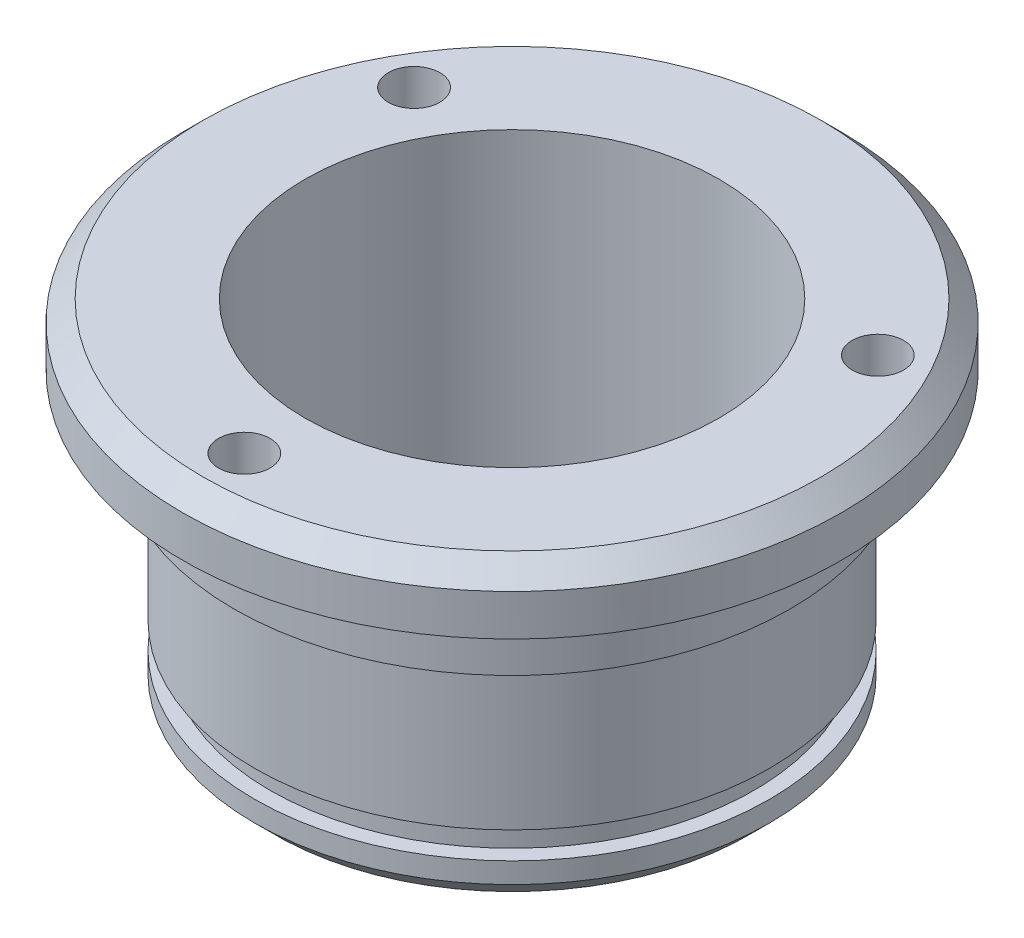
ISO-10303-21;
HEADER;
FILE_DESCRIPTION(('STEP AP214'),'2;1');
FILE_NAME('part.step','',(''),(''),'','','');
FILE_SCHEMA(('AUTOMOTIVE_DESIGN { 1 0 10303 214 1 1 1 1 }'));
ENDSEC;
DATA;
#1=APPLICATION_CONTEXT('core data for automotive mechanical design processes');
#2=APPLICATION_PROTOCOL_DEFINITION('international standard','automotive_design',2000,#1);
#3=PRODUCT_CONTEXT('',#1,'mechanical');
#4=PRODUCT('Part','Part','',(#3));
#5=PRODUCT_RELATED_PRODUCT_CATEGORY('part','',(#4));
#6=PRODUCT_DEFINITION_FORMATION('','',#4);
#7=PRODUCT_DEFINITION_CONTEXT('part definition',#1,'design');
#8=PRODUCT_DEFINITION('design','',#6,#7);
#9=PRODUCT_DEFINITION_SHAPE('','',#8);
#10=(LENGTH_UNIT() NAMED_UNIT(*) SI_UNIT(.MILLI.,.METRE.));
#11=(NAMED_UNIT(*) PLANE_ANGLE_UNIT() SI_UNIT($,.RADIAN.));
#12=(NAMED_UNIT(*) SI_UNIT($,.STERADIAN.) SOLID_ANGLE_UNIT());
#13=UNCERTAINTY_MEASURE_WITH_UNIT(LENGTH_MEASURE(1.E-05),#10,'distance_accuracy_value','');
#14=(GEOMETRIC_REPRESENTATION_CONTEXT(3) GLOBAL_UNCERTAINTY_ASSIGNED_CONTEXT((#13)) GLOBAL_UNIT_ASSIGNED_CONTEXT((#10,
#11,#12)) REPRESENTATION_CONTEXT('',''));
#15=CARTESIAN_POINT('',(0.,0.,0.));
#16=DIRECTION('',(0.,0.,1.));
#17=DIRECTION('',(1.,0.,0.));
#18=AXIS2_PLACEMENT_3D('',#15,#16,#17);
#19=CARTESIAN_POINT('',(0.,0.,0.));
#20=DIRECTION('',(0.,-1.,0.));
#21=DIRECTION('',(0.,0.,-1.));
#22=AXIS2_PLACEMENT_3D('',#19,#20,#21);
#23=CYLINDRICAL_SURFACE('',#22,10.05);
#24=CARTESIAN_POINT('',(0.,0.,0.));
#25=DIRECTION('',(0.,-1.,0.));
#26=DIRECTION('',(0.,0.,-1.));
#27=AXIS2_PLACEMENT_3D('',#24,#25,#26);
#28=CIRCLE('',#27,10.05);
#29=CARTESIAN_POINT('',(0.,0.,-10.05));
#30=VERTEX_POINT('',#29);
#31=EDGE_CURVE('E346',#30,#30,#28,.T.);
#32=ORIENTED_EDGE('',*,*,#31,.T.);
#33=EDGE_LOOP('',(#32));
#34=FACE_BOUND('',#33,.T.);
#35=CARTESIAN_POINT('',(0.,16.8,0.));
#36=DIRECTION('',(0.,-1.,0.));
#37=DIRECTION('',(0.,0.,-1.));
#38=AXIS2_PLACEMENT_3D('',#35,#36,#37);
#39=CIRCLE('',#38,10.05);
#40=CARTESIAN_POINT('',(0.,16.8,-10.05));
#41=VERTEX_POINT('',#40);
#42=EDGE_CURVE('E325',#41,#41,#39,.T.);
#43=ORIENTED_EDGE('',*,*,#42,.F.);
#44=EDGE_LOOP('',(#43));
#45=FACE_BOUND('',#44,.T.);
#46=ADVANCED_FACE('F38',(#34,#45),#23,.F.);
#47=CARTESIAN_POINT('',(12.5,0.,0.));
#48=DIRECTION('',(0.,-1.,0.));
#49=DIRECTION('',(0.,0.,-1.));
#50=AXIS2_PLACEMENT_3D('',#47,#48,#49);
#51=PLANE('',#50);
#52=CARTESIAN_POINT('',(0.,0.,0.));
#53=DIRECTION('',(0.,-1.,0.));
#54=DIRECTION('',(0.,0.,-1.));
#55=AXIS2_PLACEMENT_3D('',#52,#53,#54);
#56=CIRCLE('',#55,11.5);
#57=CARTESIAN_POINT('',(0.,0.,-11.5));
#58=VERTEX_POINT('',#57);
#59=EDGE_CURVE('E348',#58,#58,#56,.T.);
#60=ORIENTED_EDGE('',*,*,#59,.T.);
#61=EDGE_LOOP('',(#60));
#62=FACE_BOUND('',#61,.T.);
#63=ORIENTED_EDGE('',*,*,#31,.F.);
#64=EDGE_LOOP('',(#63));
#65=FACE_BOUND('',#64,.T.);
#66=ADVANCED_FACE('F136',(#62,#65),#51,.T.);
#67=CARTESIAN_POINT('',(0.,0.,0.));
#68=DIRECTION('',(0.,-1.,0.));
#69=DIRECTION('',(0.,0.,-1.));
#70=AXIS2_PLACEMENT_3D('',#67,#68,#69);
#71=CYLINDRICAL_SURFACE('',#70,12.5);
#72=CARTESIAN_POINT('',(0.,1.00000000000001,0.));
#73=DIRECTION('',(0.,-1.,0.));
#74=DIRECTION('',(0.,0.,-1.));
#75=AXIS2_PLACEMENT_3D('',#72,#73,#74);
#76=CIRCLE('',#75,12.5);
#77=CARTESIAN_POINT('',(0.,1.00000000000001,-12.5));
#78=VERTEX_POINT('',#77);
#79=EDGE_CURVE('E351',#78,#78,#76,.F.);
#80=ORIENTED_EDGE('',*,*,#79,.T.);
#81=EDGE_LOOP('',(#80));
#82=FACE_BOUND('',#81,.T.);
#83=CARTESIAN_POINT('',(0.,2.,0.));
#84=DIRECTION('',(0.,-1.,0.));
#85=DIRECTION('',(0.,0.,-1.));
#86=AXIS2_PLACEMENT_3D('',#83,#84,#85);
#87=CIRCLE('',#86,12.5);
#88=CARTESIAN_POINT('',(0.,2.,-12.5));
#89=VERTEX_POINT('',#88);
#90=EDGE_CURVE('E343',#89,#89,#87,.T.);
#91=ORIENTED_EDGE('',*,*,#90,.T.);
#92=EDGE_LOOP('',(#91));
#93=FACE_BOUND('',#92,.T.);
#94=ADVANCED_FACE('F142',(#82,#93),#71,.T.);
#95=CARTESIAN_POINT('',(12.5,2.,0.));
#96=DIRECTION('',(0.,1.,0.));
#97=DIRECTION('',(0.,0.,1.));
#98=AXIS2_PLACEMENT_3D('',#95,#96,#97);
#99=PLANE('',#98);
#100=CARTESIAN_POINT('',(0.,2.,0.));
#101=DIRECTION('',(0.,-1.,0.));
#102=DIRECTION('',(0.,0.,-1.));
#103=AXIS2_PLACEMENT_3D('',#100,#101,#102);
#104=CIRCLE('',#103,11.75);
#105=CARTESIAN_POINT('',(0.,2.,-11.75));
#106=VERTEX_POINT('',#105);
#107=EDGE_CURVE('E340',#106,#106,#104,.T.);
#108=ORIENTED_EDGE('',*,*,#107,.T.);
#109=EDGE_LOOP('',(#108));
#110=FACE_BOUND('',#109,.T.);
#111=ORIENTED_EDGE('',*,*,#90,.F.);
#112=EDGE_LOOP('',(#111));
#113=FACE_BOUND('',#112,.T.);
#114=ADVANCED_FACE('F500',(#110,#113),#99,.T.);
#115=CARTESIAN_POINT('',(0.,0.,0.));
#116=DIRECTION('',(0.,-1.,0.));
#117=DIRECTION('',(0.,0.,-1.));
#118=AXIS2_PLACEMENT_3D('',#115,#116,#117);
#119=CYLINDRICAL_SURFACE('',#118,11.75);
#120=CARTESIAN_POINT('',(0.,3.3,0.));
#121=DIRECTION('',(0.,-1.,0.));
#122=DIRECTION('',(0.,0.,-1.));
#123=AXIS2_PLACEMENT_3D('',#120,#121,#122);
#124=CIRCLE('',#123,11.75);
#125=CARTESIAN_POINT('',(0.,3.3,-11.75));
#126=VERTEX_POINT('',#125);
#127=EDGE_CURVE('E337',#126,#126,#124,.T.);
#128=ORIENTED_EDGE('',*,*,#127,.T.);
#129=EDGE_LOOP('',(#128));
#130=FACE_BOUND('',#129,.T.);
#131=ORIENTED_EDGE('',*,*,#107,.F.);
#132=EDGE_LOOP('',(#131));
#133=FACE_BOUND('',#132,.T.);
#134=ADVANCED_FACE('F490',(#130,#133),#119,.T.);
#135=CARTESIAN_POINT('',(11.75,3.3,0.));
#136=DIRECTION('',(0.,-1.,0.));
#137=DIRECTION('',(0.,0.,-1.));
#138=AXIS2_PLACEMENT_3D('',#135,#136,#137);
#139=PLANE('',#138);
#140=CARTESIAN_POINT('',(0.,3.3,0.));
#141=DIRECTION('',(0.,-1.,0.));
#142=DIRECTION('',(0.,0.,-1.));
#143=AXIS2_PLACEMENT_3D('',#140,#141,#142);
#144=CIRCLE('',#143,12.5);
#145=CARTESIAN_POINT('',(0.,3.3,-12.5));
#146=VERTEX_POINT('',#145);
#147=EDGE_CURVE('E334',#146,#146,#144,.T.);
#148=ORIENTED_EDGE('',*,*,#147,.T.);
#149=EDGE_LOOP('',(#148));
#150=FACE_BOUND('',#149,.T.);
#151=ORIENTED_EDGE('',*,*,#127,.F.);
#152=EDGE_LOOP('',(#151));
#153=FACE_BOUND('',#152,.T.);
#154=ADVANCED_FACE('F482',(#150,#153),#139,.T.);
#155=CARTESIAN_POINT('',(0.,0.,0.));
#156=DIRECTION('',(0.,-1.,0.));
#157=DIRECTION('',(0.,0.,-1.));
#158=AXIS2_PLACEMENT_3D('',#155,#156,#157);
#159=CYLINDRICAL_SURFACE('',#158,12.5);
#160=CARTESIAN_POINT('',(0.,10.3,0.));
#161=DIRECTION('',(0.,-1.,0.));
#162=DIRECTION('',(0.,0.,-1.));
#163=AXIS2_PLACEMENT_3D('',#160,#161,#162);
#164=CIRCLE('',#163,12.5);
#165=CARTESIAN_POINT('',(0.,10.3,-12.5));
#166=VERTEX_POINT('',#165);
#167=EDGE_CURVE('E250',#166,#166,#164,.T.);
#168=ORIENTED_EDGE('',*,*,#167,.T.);
#169=EDGE_LOOP('',(#168));
#170=FACE_BOUND('',#169,.T.);
#171=ORIENTED_EDGE('',*,*,#147,.F.);
#172=EDGE_LOOP('',(#171));
#173=FACE_BOUND('',#172,.T.);
#174=ADVANCED_FACE('F476',(#170,#173),#159,.T.);
#175=CARTESIAN_POINT('',(12.5,10.5,0.));
#176=DIRECTION('',(0.,-1.,0.));
#177=DIRECTION('',(0.,0.,-1.));
#178=AXIS2_PLACEMENT_3D('',#175,#176,#177);
#179=PLANE('',#178);
#180=CARTESIAN_POINT('',(0.,10.5,0.));
#181=DIRECTION('',(0.,-1.,0.));
#182=DIRECTION('',(0.,0.,-1.));
#183=AXIS2_PLACEMENT_3D('',#180,#181,#182);
#184=CIRCLE('',#183,12.7);
#185=CARTESIAN_POINT('',(0.,10.5,-12.7));
#186=VERTEX_POINT('',#185);
#187=EDGE_CURVE('E252',#186,#186,#184,.F.);
#188=ORIENTED_EDGE('',*,*,#187,.T.);
#189=EDGE_LOOP('',(#188));
#190=FACE_BOUND('',#189,.T.);
#191=CARTESIAN_POINT('',(0.,10.5,0.));
#192=DIRECTION('',(0.,-1.,0.));
#193=DIRECTION('',(0.,0.,-1.));
#194=AXIS2_PLACEMENT_3D('',#191,#192,#193);
#195=CIRCLE('',#194,13.5);
#196=CARTESIAN_POINT('',(0.,10.5,-13.5));
#197=VERTEX_POINT('',#196);
#198=EDGE_CURVE('E331',#197,#197,#195,.T.);
#199=ORIENTED_EDGE('',*,*,#198,.T.);
#200=EDGE_LOOP('',(#199));
#201=FACE_BOUND('',#200,.T.);
#202=ADVANCED_FACE('F295',(#190,#201),#179,.T.);
#203=CARTESIAN_POINT('',(0.,0.,0.));
#204=DIRECTION('',(0.,-1.,0.));
#205=DIRECTION('',(0.,0.,-1.));
#206=AXIS2_PLACEMENT_3D('',#203,#204,#205);
#207=CYLINDRICAL_SURFACE('',#206,13.5);
#208=DIRECTION('',(0.,1.,0.));
#209=VECTOR('',#208,1.);
#210=CARTESIAN_POINT('',(-1.16637578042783,14.8,13.4495192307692));
#211=LINE('',#210,#209);
#212=CARTESIAN_POINT('',(-1.16637578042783,13.6,13.4495192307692));
#213=VERTEX_POINT('',#212);
#214=CARTESIAN_POINT('',(-1.16637578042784,12.8,13.4495192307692));
#215=VERTEX_POINT('',#214);
#216=EDGE_CURVE('E274',#213,#215,#211,.F.);
#217=ORIENTED_EDGE('',*,*,#216,.F.);
#218=CARTESIAN_POINT('',(0.,13.6,0.));
#219=DIRECTION('',(0.,-1.,0.));
#220=DIRECTION('',(0.,0.,-1.));
#221=AXIS2_PLACEMENT_3D('',#218,#219,#220);
#222=CIRCLE('',#221,13.5);
#223=CARTESIAN_POINT('',(-12.2308132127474,13.6,-5.71464855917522));
#224=VERTEX_POINT('',#223);
#225=EDGE_CURVE('E243',#213,#224,#222,.T.);
#226=ORIENTED_EDGE('',*,*,#225,.T.);
#227=DIRECTION('',(0.,1.,0.));
#228=VECTOR('',#227,1.);
#229=CARTESIAN_POINT('',(-12.2308132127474,14.8,-5.71464855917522));
#230=LINE('',#229,#228);
#231=CARTESIAN_POINT('',(-12.2308132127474,12.8,-5.71464855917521));
#232=VERTEX_POINT('',#231);
#233=EDGE_CURVE('E263',#232,#224,#230,.T.);
#234=ORIENTED_EDGE('',*,*,#233,.F.);
#235=CARTESIAN_POINT('',(-11.0642251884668,12.8002,-7.73517426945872));
#236=CARTESIAN_POINT('',(-11.0946707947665,12.771543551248,-7.6916232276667));
#237=CARTESIAN_POINT('',(-11.1249231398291,12.7430743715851,-7.64780564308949));
#238=CARTESIAN_POINT('',(-11.1851538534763,12.6868200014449,-7.55944475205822));
#239=CARTESIAN_POINT('',(-11.2151318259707,12.6590357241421,-7.51490059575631));
#240=CARTESIAN_POINT('',(-11.2764758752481,12.6030507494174,-7.42255539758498));
#241=CARTESIAN_POINT('',(-11.3078286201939,12.5749098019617,-7.37470911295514));
#242=CARTESIAN_POINT('',(-11.3704177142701,12.5206247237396,-7.27783821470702));
#243=CARTESIAN_POINT('',(-11.401654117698,12.4944795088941,-7.2288142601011));
#244=CARTESIAN_POINT('',(-11.44962177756,12.4572175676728,-7.15242192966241));
#245=CARTESIAN_POINT('',(-11.4662971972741,12.4447956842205,-7.12566064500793));
#246=CARTESIAN_POINT('',(-11.4997504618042,12.4214148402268,-7.07154523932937));
#247=CARTESIAN_POINT('',(-11.5165283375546,12.4104563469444,-7.04419093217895));
#248=CARTESIAN_POINT('',(-11.5499009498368,12.3907893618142,-6.98933465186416));
#249=CARTESIAN_POINT('',(-11.5664931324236,12.3820421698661,-6.96184529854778));
#250=CARTESIAN_POINT('',(-11.599789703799,12.3672769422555,-6.90622376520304));
#251=CARTESIAN_POINT('',(-11.6164939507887,12.3612559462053,-6.87809231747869));
#252=CARTESIAN_POINT('',(-11.6471219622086,12.3533942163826,-6.82607512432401));
#253=CARTESIAN_POINT('',(-11.6610418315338,12.3510214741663,-6.80226926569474));
#254=CARTESIAN_POINT('',(-11.6887826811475,12.3489307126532,-6.75448902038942));
#255=CARTESIAN_POINT('',(-11.7026036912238,12.3492118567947,-6.73051468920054));
#256=CARTESIAN_POINT('',(-11.7302640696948,12.3524230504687,-6.6821922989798));
#257=CARTESIAN_POINT('',(-11.7440994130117,12.3554000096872,-6.65784515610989));
#258=CARTESIAN_POINT('',(-11.7714408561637,12.3637430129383,-6.60938386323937));
#259=CARTESIAN_POINT('',(-11.784946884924,12.3691095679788,-6.58526976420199));
#260=CARTESIAN_POINT('',(-11.8195326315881,12.3855370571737,-6.5230792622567));
#261=CARTESIAN_POINT('',(-11.8403296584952,12.3980856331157,-6.48524539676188));
#262=CARTESIAN_POINT('',(-11.8810747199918,12.4263619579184,-6.41029547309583));
#263=CARTESIAN_POINT('',(-11.9010214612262,12.4420943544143,-6.37318055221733));
#264=CARTESIAN_POINT('',(-11.9403130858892,12.4756715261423,-6.29926069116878));
#265=CARTESIAN_POINT('',(-11.9596534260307,12.4935288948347,-6.26245914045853));
#266=CARTESIAN_POINT('',(-11.9977099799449,12.5305539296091,-6.1892370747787));
#267=CARTESIAN_POINT('',(-12.0164265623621,12.5497208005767,-6.15281634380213));
#268=CARTESIAN_POINT('',(-12.06938439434,12.605961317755,-6.0486167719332));
#269=CARTESIAN_POINT('',(-12.1029794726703,12.6441190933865,-5.98109702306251));
#270=CARTESIAN_POINT('',(-12.1520387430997,12.7022524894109,-5.88041824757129));
#271=CARTESIAN_POINT('',(-12.168063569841,12.721643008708,-5.84718596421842));
#272=CARTESIAN_POINT('',(-12.1997688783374,12.7607186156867,-5.7807434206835));
#273=CARTESIAN_POINT('',(-12.2154494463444,12.7804036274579,-5.7475331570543));
#274=CARTESIAN_POINT('',(-12.2309700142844,12.8002,-5.71431295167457));
#275=B_SPLINE_CURVE_WITH_KNOTS('',3,(#235,#236,#237,#238,#239,#240,#241,#242,#243,#244,#245,
#246,#247,#248,#249,#250,#251,#252,#253,#254,#255,#256,#257,#258,#259,#260,#261,#262,#263,#264,
#265,#266,#267,#268,#269,#270,#271,#272,#273,#274),.UNSPECIFIED.,.F.,.F.,(4,2,2,2,2,2,2,2,2,2,2,
2,2,2,2,2,2,2,2,4),(0.,0.181125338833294,0.362480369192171,0.553713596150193,0.744842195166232,
0.846487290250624,0.948164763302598,1.04791557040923,1.1475577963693,1.23047578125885,
1.31336762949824,1.39773018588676,1.48211079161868,1.61677285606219,1.75163293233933,
1.88733628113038,2.02295795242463,2.27645936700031,2.40149695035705,2.52650284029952),.UNSPECIFIED.);
#276=CARTESIAN_POINT('',(-11.0644374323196,12.8,-7.73487067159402));
#277=VERTEX_POINT('',#276);
#278=EDGE_CURVE('E279',#277,#232,#275,.T.);
#279=ORIENTED_EDGE('',*,*,#278,.F.);
#280=DIRECTION('',(0.,1.,0.));
#281=VECTOR('',#280,1.);
#282=CARTESIAN_POINT('',(-11.0644374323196,14.8,-7.73487067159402));
#283=LINE('',#282,#281);
#284=CARTESIAN_POINT('',(-11.0644374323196,13.6,-7.73487067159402));
#285=VERTEX_POINT('',#284);
#286=EDGE_CURVE('E307',#285,#277,#283,.F.);
#287=ORIENTED_EDGE('',*,*,#286,.F.);
#288=CARTESIAN_POINT('',(0.,13.6,0.));
#289=DIRECTION('',(0.,-1.,0.));
#290=DIRECTION('',(0.,0.,-1.));
#291=AXIS2_PLACEMENT_3D('',#288,#289,#290);
#292=CIRCLE('',#291,13.5);
#293=CARTESIAN_POINT('',(11.0644374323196,13.6,-7.73487067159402));
#294=VERTEX_POINT('',#293);
#295=EDGE_CURVE('E235',#285,#294,#292,.T.);
#296=ORIENTED_EDGE('',*,*,#295,.T.);
#297=DIRECTION('',(0.,1.,0.));
#298=VECTOR('',#297,1.);
#299=CARTESIAN_POINT('',(11.0644374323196,14.8,-7.73487067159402));
#300=LINE('',#299,#298);
#301=CARTESIAN_POINT('',(11.0644374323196,12.8,-7.73487067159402));
#302=VERTEX_POINT('',#301);
#303=EDGE_CURVE('E233',#302,#294,#300,.T.);
#304=ORIENTED_EDGE('',*,*,#303,.F.);
#305=CARTESIAN_POINT('',(12.2309700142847,12.8002000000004,-5.71431295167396));
#306=CARTESIAN_POINT('',(12.2084765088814,12.7715435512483,-5.76245514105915));
#307=CARTESIAN_POINT('',(12.1856555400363,12.7430743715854,-5.81056323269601));
#308=CARTESIAN_POINT('',(12.1392481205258,12.6868200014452,-5.90690500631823));
#309=CARTESIAN_POINT('',(12.1156607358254,12.6590357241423,-5.9551387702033));
#310=CARTESIAN_POINT('',(12.0663594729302,12.6030507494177,-6.05443687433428));
#311=CARTESIAN_POINT('',(12.0405997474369,12.574909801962,-6.10551229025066));
#312=CARTESIAN_POINT('',(11.9880016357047,12.5206247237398,-6.20815148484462));
#313=CARTESIAN_POINT('',(11.961163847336,12.4944795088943,-6.25971498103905));
#314=CARTESIAN_POINT('',(11.9189899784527,12.4572175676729,-6.33945235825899));
#315=CARTESIAN_POINT('',(11.9041517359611,12.4447956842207,-6.3672743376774));
#316=CARTESIAN_POINT('',(11.8740130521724,12.4214148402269,-6.42330341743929));
#317=CARTESIAN_POINT('',(11.8587124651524,12.4104563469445,-6.45151063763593));
#318=CARTESIAN_POINT('',(11.8278918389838,12.3907893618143,-6.50784030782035));
#319=CARTESIAN_POINT('',(11.8123814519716,12.3820421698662,-6.53595423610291));
#320=CARTESIAN_POINT('',(11.7808600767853,12.3672769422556,-6.59260067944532));
#321=CARTESIAN_POINT('',(11.7648496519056,12.3612559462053,-6.62113270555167));
#322=CARTESIAN_POINT('',(11.7351154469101,12.3533942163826,-6.6736659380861));
#323=CARTESIAN_POINT('',(11.7214589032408,12.3510214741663,-6.69762382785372));
#324=CARTESIAN_POINT('',(11.6939504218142,12.3489307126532,-6.74553823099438));
#325=CARTESIAN_POINT('',(11.680098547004,12.3492118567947,-6.76949474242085));
#326=CARTESIAN_POINT('',(11.6520803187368,12.3524230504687,-6.8176105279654));
#327=CARTESIAN_POINT('',(11.6379127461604,12.3554000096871,-6.84176585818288));
#328=CARTESIAN_POINT('',(11.6096147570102,12.3637430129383,-6.88967488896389));
#329=CARTESIAN_POINT('',(11.5954843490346,12.3691095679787,-6.91342850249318));
#330=CARTESIAN_POINT('',(11.558918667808,12.3855370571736,-6.97447588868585));
#331=CARTESIAN_POINT('',(11.5365520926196,12.3980856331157,-7.01140357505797));
#332=CARTESIAN_POINT('',(11.4920160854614,12.4263619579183,-7.08416479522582));
#333=CARTESIAN_POINT('',(11.4698469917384,12.4420943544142,-7.11999664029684));
#334=CARTESIAN_POINT('',(11.4254763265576,12.4756715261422,-7.19098411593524));
#335=CARTESIAN_POINT('',(11.4032754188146,12.4935288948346,-7.22613411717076));
#336=CARTESIAN_POINT('',(11.3588915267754,12.530553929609,-7.29570309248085));
#337=CARTESIAN_POINT('',(11.3367085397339,12.5497208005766,-7.33012249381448));
#338=CARTESIAN_POINT('',(11.2729479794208,12.6059613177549,-7.42808510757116));
#339=CARTESIAN_POINT('',(11.2312717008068,12.6441190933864,-7.49093917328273));
#340=CARTESIAN_POINT('',(11.1686109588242,12.7022524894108,-7.58376513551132));
#341=CARTESIAN_POINT('',(11.1478433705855,12.7216430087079,-7.61425918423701));
#342=CARTESIAN_POINT('',(11.1061550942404,12.7607186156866,-7.6749380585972));
#343=CARTESIAN_POINT('',(11.0852344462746,12.7804036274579,-7.70512296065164));
#344=CARTESIAN_POINT('',(11.0642251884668,12.8002,-7.73517426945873));
#345=B_SPLINE_CURVE_WITH_KNOTS('',3,(#305,#306,#307,#308,#309,#310,#311,#312,#313,#314,#315,
#316,#317,#318,#319,#320,#321,#322,#323,#324,#325,#326,#327,#328,#329,#330,#331,#332,#333,#334,
#335,#336,#337,#338,#339,#340,#341,#342,#343,#344),.UNSPECIFIED.,.F.,.F.,(4,2,2,2,2,2,2,2,2,2,2,
2,2,2,2,2,2,2,2,4),(0.,0.181125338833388,0.362480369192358,0.553713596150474,0.744842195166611,
0.846487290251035,0.948164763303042,1.0479155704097,1.14755779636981,1.23047578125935,
1.31336762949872,1.39773018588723,1.48211079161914,1.61677285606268,1.75163293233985,
1.88733628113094,2.02295795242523,2.27645936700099,2.40149695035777,2.52650284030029),.UNSPECIFIED.);
#346=CARTESIAN_POINT('',(12.2308132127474,12.8,-5.71464855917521));
#347=VERTEX_POINT('',#346);
#348=EDGE_CURVE('E232',#347,#302,#345,.T.);
#349=ORIENTED_EDGE('',*,*,#348,.F.);
#350=DIRECTION('',(0.,1.,0.));
#351=VECTOR('',#350,1.);
#352=CARTESIAN_POINT('',(12.2308132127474,14.8,-5.71464855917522));
#353=LINE('',#352,#351);
#354=CARTESIAN_POINT('',(12.2308132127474,13.6,-5.71464855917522));
#355=VERTEX_POINT('',#354);
#356=EDGE_CURVE('E221',#355,#347,#353,.F.);
#357=ORIENTED_EDGE('',*,*,#356,.F.);
#358=CARTESIAN_POINT('',(0.,13.6,0.));
#359=DIRECTION('',(0.,-1.,0.));
#360=DIRECTION('',(0.,0.,-1.));
#361=AXIS2_PLACEMENT_3D('',#358,#359,#360);
#362=CIRCLE('',#361,13.5);
#363=CARTESIAN_POINT('',(1.16637578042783,13.6,13.4495192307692));
#364=VERTEX_POINT('',#363);
#365=EDGE_CURVE('E216',#355,#364,#362,.T.);
#366=ORIENTED_EDGE('',*,*,#365,.T.);
#367=DIRECTION('',(0.,1.,0.));
#368=VECTOR('',#367,1.);
#369=CARTESIAN_POINT('',(1.16637578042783,14.8,13.4495192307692));
#370=LINE('',#369,#368);
#371=CARTESIAN_POINT('',(1.16637578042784,12.8,13.4495192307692));
#372=VERTEX_POINT('',#371);
#373=EDGE_CURVE('E280',#372,#364,#370,.T.);
#374=ORIENTED_EDGE('',*,*,#373,.F.);
#375=CARTESIAN_POINT('',(-1.16674482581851,12.8002000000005,13.4494872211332));
#376=CARTESIAN_POINT('',(-1.11380571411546,12.7715435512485,13.4540783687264));
#377=CARTESIAN_POINT('',(-1.06073240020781,12.7430743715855,13.458368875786));
#378=CARTESIAN_POINT('',(-0.95409426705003,12.6868200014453,13.4663497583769));
#379=CARTESIAN_POINT('',(-0.900528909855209,12.6590357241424,13.4700393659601));
#380=CARTESIAN_POINT('',(-0.789883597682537,12.6030507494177,13.4769922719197));
#381=CARTESIAN_POINT('',(-0.732771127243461,12.5749098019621,13.4802214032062));
#382=CARTESIAN_POINT('',(-0.617583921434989,12.5206247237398,13.485989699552));
#383=CARTESIAN_POINT('',(-0.55950972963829,12.4944795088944,13.4885292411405));
#384=CARTESIAN_POINT('',(-0.469368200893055,12.457217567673,13.4918742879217));
#385=CARTESIAN_POINT('',(-0.437854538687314,12.4447956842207,13.4929349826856));
#386=CARTESIAN_POINT('',(-0.374262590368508,12.421414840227,13.4948486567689));
#387=CARTESIAN_POINT('',(-0.342184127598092,12.4104563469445,13.4957015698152));
#388=CARTESIAN_POINT('',(-0.277990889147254,12.3907893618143,13.4971749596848));
#389=CARTESIAN_POINT('',(-0.245888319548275,12.3820421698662,13.4977995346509));
#390=CARTESIAN_POINT('',(-0.18107037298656,12.3672769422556,13.4988244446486));
#391=CARTESIAN_POINT('',(-0.148355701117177,12.3612559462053,13.4992250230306));
#392=CARTESIAN_POINT('',(-0.0879934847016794,12.3533942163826,13.4997410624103));
#393=CARTESIAN_POINT('',(-0.0604170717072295,12.3510214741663,13.4998930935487));
#394=CARTESIAN_POINT('',(-0.0051677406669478,12.3489307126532,13.500027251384));
#395=CARTESIAN_POINT('',(0.0225051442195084,12.3492118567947,13.5000094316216));
#396=CARTESIAN_POINT('',(0.0781837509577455,12.3524230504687,13.4998028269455));
#397=CARTESIAN_POINT('',(0.106186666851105,12.3554000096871,13.499611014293));
#398=CARTESIAN_POINT('',(0.161826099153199,12.3637430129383,13.4990587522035));
#399=CARTESIAN_POINT('',(0.189462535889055,12.3691095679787,13.4986982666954));
#400=CARTESIAN_POINT('',(0.260613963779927,12.3855370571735,13.4975551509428));
#401=CARTESIAN_POINT('',(0.303777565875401,12.3980856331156,13.4966489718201));
#402=CARTESIAN_POINT('',(0.389058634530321,12.4263619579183,13.4944602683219));
#403=CARTESIAN_POINT('',(0.43117446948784,12.4420943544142,13.4931771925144));
#404=CARTESIAN_POINT('',(0.514836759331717,12.4756715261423,13.4902448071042));
#405=CARTESIAN_POINT('',(0.556378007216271,12.4935288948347,13.4885932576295));
#406=CARTESIAN_POINT('',(0.638818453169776,12.5305539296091,13.4849401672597));
#407=CARTESIAN_POINT('',(0.67971802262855,12.5497208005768,13.4829388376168));
#408=CARTESIAN_POINT('',(0.796436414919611,12.6059613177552,13.4767018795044));
#409=CARTESIAN_POINT('',(0.871707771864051,12.6441190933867,13.4720361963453));
#410=CARTESIAN_POINT('',(0.983427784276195,12.7022524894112,13.4641833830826));
#411=CARTESIAN_POINT('',(1.02022019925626,12.7216430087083,13.4614451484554));
#412=CARTESIAN_POINT('',(1.09361378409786,12.7607186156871,13.4556814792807));
#413=CARTESIAN_POINT('',(1.13021500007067,12.7804036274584,13.4526561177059));
#414=CARTESIAN_POINT('',(1.16674482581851,12.8002000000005,13.4494872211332));
#415=B_SPLINE_CURVE_WITH_KNOTS('',3,(#375,#376,#377,#378,#379,#380,#381,#382,#383,#384,#385,
#386,#387,#388,#389,#390,#391,#392,#393,#394,#395,#396,#397,#398,#399,#400,#401,#402,#403,#404,
#405,#406,#407,#408,#409,#410,#411,#412,#413,#414),.UNSPECIFIED.,.F.,.F.,(4,2,2,2,2,2,2,2,2,2,2,
2,2,2,2,2,2,2,2,4),(0.,0.181125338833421,0.362480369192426,0.553713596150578,0.74484219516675,
0.846487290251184,0.9481647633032,1.04791557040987,1.14755779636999,1.23047578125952,
1.31336762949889,1.39773018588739,1.4821107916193,1.61677285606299,1.75163293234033,
1.88733628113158,2.02295795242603,2.27645936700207,2.40149695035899,2.52650284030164),.UNSPECIFIED.);
#416=EDGE_CURVE('E278',#215,#372,#415,.T.);
#417=ORIENTED_EDGE('',*,*,#416,.F.);
#418=EDGE_LOOP('',(#217,#226,#234,#279,#287,#296,#304,#349,#357,#366,#374,#417));
#419=FACE_BOUND('',#418,.T.);
#420=ORIENTED_EDGE('',*,*,#198,.F.);
#421=EDGE_LOOP('',(#420));
#422=FACE_BOUND('',#421,.T.);
#423=ADVANCED_FACE('F228',(#419,#422),#207,.T.);
#424=CARTESIAN_POINT('',(13.5,13.8,0.));
#425=DIRECTION('',(0.,-1.,0.));
#426=DIRECTION('',(0.,0.,-1.));
#427=AXIS2_PLACEMENT_3D('',#424,#425,#426);
#428=PLANE('',#427);
#429=CARTESIAN_POINT('',(-11.2583302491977,13.8,-6.5));
#430=DIRECTION('',(0.,-1.,0.));
#431=DIRECTION('',(0.,0.,-1.));
#432=AXIS2_PLACEMENT_3D('',#429,#430,#431);
#433=CIRCLE('',#432,1.24999999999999);
#434=CARTESIAN_POINT('',(-12.359990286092,13.8,-5.90936884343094));
#435=VERTEX_POINT('',#434);
#436=CARTESIAN_POINT('',(-11.2976586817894,13.8,-7.74938115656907));
#437=VERTEX_POINT('',#436);
#438=EDGE_CURVE('E259',#435,#437,#433,.T.);
#439=ORIENTED_EDGE('',*,*,#438,.F.);
#440=CARTESIAN_POINT('',(0.,13.8,0.));
#441=DIRECTION('',(0.,-1.,0.));
#442=DIRECTION('',(0.,0.,-1.));
#443=AXIS2_PLACEMENT_3D('',#440,#441,#442);
#444=CIRCLE('',#443,13.7);
#445=CARTESIAN_POINT('',(-1.06233160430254,13.8,13.65875));
#446=VERTEX_POINT('',#445);
#447=EDGE_CURVE('E57',#435,#446,#444,.F.);
#448=ORIENTED_EDGE('',*,*,#447,.T.);
#449=CARTESIAN_POINT('',(0.,13.8,13.));
#450=DIRECTION('',(0.,-1.,0.));
#451=DIRECTION('',(0.,0.,-1.));
#452=AXIS2_PLACEMENT_3D('',#449,#450,#451);
#453=CIRCLE('',#452,1.24999999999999);
#454=CARTESIAN_POINT('',(1.06233160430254,13.8,13.65875));
#455=VERTEX_POINT('',#454);
#456=EDGE_CURVE('E276',#455,#446,#453,.T.);
#457=ORIENTED_EDGE('',*,*,#456,.F.);
#458=CARTESIAN_POINT('',(0.,13.8,0.));
#459=DIRECTION('',(0.,-1.,0.));
#460=DIRECTION('',(0.,0.,-1.));
#461=AXIS2_PLACEMENT_3D('',#458,#459,#460);
#462=CIRCLE('',#461,13.7);
#463=CARTESIAN_POINT('',(12.359990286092,13.8,-5.90936884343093));
#464=VERTEX_POINT('',#463);
#465=EDGE_CURVE('E214',#455,#464,#462,.F.);
#466=ORIENTED_EDGE('',*,*,#465,.T.);
#467=CARTESIAN_POINT('',(11.2583302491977,13.8,-6.5));
#468=DIRECTION('',(0.,-1.,0.));
#469=DIRECTION('',(0.,0.,-1.));
#470=AXIS2_PLACEMENT_3D('',#467,#468,#469);
#471=CIRCLE('',#470,1.24999999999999);
#472=CARTESIAN_POINT('',(11.2976586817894,13.8,-7.74938115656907));
#473=VERTEX_POINT('',#472);
#474=EDGE_CURVE('E224',#473,#464,#471,.T.);
#475=ORIENTED_EDGE('',*,*,#474,.F.);
#476=CARTESIAN_POINT('',(0.,13.8,0.));
#477=DIRECTION('',(0.,-1.,0.));
#478=DIRECTION('',(0.,0.,-1.));
#479=AXIS2_PLACEMENT_3D('',#476,#477,#478);
#480=CIRCLE('',#479,13.7);
#481=EDGE_CURVE('E247',#473,#437,#480,.F.);
#482=ORIENTED_EDGE('',*,*,#481,.T.);
#483=EDGE_LOOP('',(#439,#448,#457,#466,#475,#482));
#484=FACE_BOUND('',#483,.T.);
#485=CARTESIAN_POINT('',(0.,13.8,0.));
#486=DIRECTION('',(0.,-1.,0.));
#487=DIRECTION('',(0.,0.,-1.));
#488=AXIS2_PLACEMENT_3D('',#485,#486,#487);
#489=CIRCLE('',#488,16.);
#490=CARTESIAN_POINT('',(0.,13.8,-16.));
#491=VERTEX_POINT('',#490);
#492=EDGE_CURVE('E328',#491,#491,#489,.T.);
#493=ORIENTED_EDGE('',*,*,#492,.T.);
#494=EDGE_LOOP('',(#493));
#495=FACE_BOUND('',#494,.T.);
#496=ADVANCED_FACE('F265',(#484,#495),#428,.T.);
#497=CARTESIAN_POINT('',(0.,0.,0.));
#498=DIRECTION('',(0.,-1.,0.));
#499=DIRECTION('',(0.,0.,-1.));
#500=AXIS2_PLACEMENT_3D('',#497,#498,#499);
#501=CYLINDRICAL_SURFACE('',#500,16.);
#502=CARTESIAN_POINT('',(0.,15.8,0.));
#503=DIRECTION('',(0.,1.,0.));
#504=DIRECTION('',(0.,0.,1.));
#505=AXIS2_PLACEMENT_3D('',#502,#503,#504);
#506=CIRCLE('',#505,16.);
#507=CARTESIAN_POINT('',(0.,15.8,16.));
#508=VERTEX_POINT('',#507);
#509=EDGE_CURVE('E354',#508,#508,#506,.F.);
#510=ORIENTED_EDGE('',*,*,#509,.T.);
#511=EDGE_LOOP('',(#510));
#512=FACE_BOUND('',#511,.T.);
#513=ORIENTED_EDGE('',*,*,#492,.F.);
#514=EDGE_LOOP('',(#513));
#515=FACE_BOUND('',#514,.T.);
#516=ADVANCED_FACE('F452',(#512,#515),#501,.T.);
#517=CARTESIAN_POINT('',(16.,16.8,0.));
#518=DIRECTION('',(0.,1.,0.));
#519=DIRECTION('',(0.,0.,1.));
#520=AXIS2_PLACEMENT_3D('',#517,#518,#519);
#521=PLANE('',#520);
#522=CARTESIAN_POINT('',(11.2583302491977,16.8,-6.5));
#523=DIRECTION('',(0.,1.,0.));
#524=DIRECTION('',(0.,0.,1.));
#525=AXIS2_PLACEMENT_3D('',#522,#523,#524);
#526=CIRCLE('',#525,1.24999999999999);
#527=CARTESIAN_POINT('',(11.2583302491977,16.8,-5.25000000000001));
#528=VERTEX_POINT('',#527);
#529=EDGE_CURVE('E562',#528,#528,#526,.T.);
#530=ORIENTED_EDGE('',*,*,#529,.F.);
#531=EDGE_LOOP('',(#530));
#532=FACE_BOUND('',#531,.T.);
#533=CARTESIAN_POINT('',(-11.2583302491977,16.8,-6.5));
#534=DIRECTION('',(0.,1.,0.));
#535=DIRECTION('',(0.,0.,1.));
#536=AXIS2_PLACEMENT_3D('',#533,#534,#535);
#537=CIRCLE('',#536,1.24999999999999);
#538=CARTESIAN_POINT('',(-11.2583302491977,16.8,-5.25000000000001));
#539=VERTEX_POINT('',#538);
#540=EDGE_CURVE('E314',#539,#539,#537,.T.);
#541=ORIENTED_EDGE('',*,*,#540,.F.);
#542=EDGE_LOOP('',(#541));
#543=FACE_BOUND('',#542,.T.);
#544=CARTESIAN_POINT('',(0.,16.8,13.));
#545=DIRECTION('',(0.,1.,0.));
#546=DIRECTION('',(0.,0.,1.));
#547=AXIS2_PLACEMENT_3D('',#544,#545,#546);
#548=CIRCLE('',#547,1.24999999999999);
#549=CARTESIAN_POINT('',(0.,16.8,14.25));
#550=VERTEX_POINT('',#549);
#551=EDGE_CURVE('E268',#550,#550,#548,.T.);
#552=ORIENTED_EDGE('',*,*,#551,.F.);
#553=EDGE_LOOP('',(#552));
#554=FACE_BOUND('',#553,.T.);
#555=CARTESIAN_POINT('',(0.,16.8,0.));
#556=DIRECTION('',(0.,1.,0.));
#557=DIRECTION('',(0.,0.,1.));
#558=AXIS2_PLACEMENT_3D('',#555,#556,#557);
#559=CIRCLE('',#558,15.);
#560=CARTESIAN_POINT('',(0.,16.8,15.));
#561=VERTEX_POINT('',#560);
#562=EDGE_CURVE('E356',#561,#561,#559,.T.);
#563=ORIENTED_EDGE('',*,*,#562,.T.);
#564=EDGE_LOOP('',(#563));
#565=FACE_BOUND('',#564,.T.);
#566=ORIENTED_EDGE('',*,*,#42,.T.);
#567=EDGE_LOOP('',(#566));
#568=FACE_BOUND('',#567,.T.);
#569=ADVANCED_FACE('F153',(#532,#543,#554,#565,#568),#521,.T.);
#570=CARTESIAN_POINT('',(0.,0.,0.));
#571=DIRECTION('',(0.,1.,0.));
#572=DIRECTION('',(0.,0.,1.));
#573=AXIS2_PLACEMENT_3D('',#570,#571,#572);
#574=CONICAL_SURFACE('',#573,11.5,0.785398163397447);
#575=ORIENTED_EDGE('',*,*,#79,.F.);
#576=EDGE_LOOP('',(#575));
#577=FACE_BOUND('',#576,.T.);
#578=ORIENTED_EDGE('',*,*,#59,.F.);
#579=EDGE_LOOP('',(#578));
#580=FACE_BOUND('',#579,.T.);
#581=ADVANCED_FACE('F149',(#577,#580),#574,.T.);
#582=CARTESIAN_POINT('',(0.,15.8,0.));
#583=DIRECTION('',(0.,-1.,0.));
#584=DIRECTION('',(0.,0.,-1.));
#585=AXIS2_PLACEMENT_3D('',#582,#583,#584);
#586=CONICAL_SURFACE('',#585,16.,0.785398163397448);
#587=ORIENTED_EDGE('',*,*,#562,.F.);
#588=EDGE_LOOP('',(#587));
#589=FACE_BOUND('',#588,.T.);
#590=ORIENTED_EDGE('',*,*,#509,.F.);
#591=EDGE_LOOP('',(#590));
#592=FACE_BOUND('',#591,.T.);
#593=ADVANCED_FACE('F152',(#589,#592),#586,.T.);
#594=CARTESIAN_POINT('',(0.,12.8,13.));
#595=DIRECTION('',(0.,1.,0.));
#596=DIRECTION('',(0.,0.,1.));
#597=AXIS2_PLACEMENT_3D('',#594,#595,#596);
#598=CONICAL_SURFACE('',#597,1.25,1.02974425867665);
#599=ORIENTED_EDGE('',*,*,#416,.T.);
#600=CARTESIAN_POINT('',(0.,12.8,13.));
#601=DIRECTION('',(0.,1.,0.));
#602=DIRECTION('',(0.,0.,1.));
#603=AXIS2_PLACEMENT_3D('',#600,#601,#602);
#604=CIRCLE('',#603,1.25);
#605=EDGE_CURVE('E322',#372,#215,#604,.T.);
#606=ORIENTED_EDGE('',*,*,#605,.T.);
#607=EDGE_LOOP('',(#599,#606));
#608=FACE_BOUND('',#607,.T.);
#609=CARTESIAN_POINT('',(0.,12.0489242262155,13.));
#610=VERTEX_POINT('',#609);
#611=VERTEX_LOOP('',#610);
#612=FACE_BOUND('',#611,.T.);
#613=ADVANCED_FACE('F157',(#608,#612),#598,.F.);
#614=CARTESIAN_POINT('',(0.,16.8,13.));
#615=DIRECTION('',(0.,1.,0.));
#616=DIRECTION('',(0.,0.,1.));
#617=AXIS2_PLACEMENT_3D('',#614,#615,#616);
#618=CYLINDRICAL_SURFACE('',#617,1.24999999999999);
#619=ORIENTED_EDGE('',*,*,#456,.T.);
#620=CARTESIAN_POINT('',(-1.06233160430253,13.8,13.65875));
#621=CARTESIAN_POINT('',(-1.07128861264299,13.8000137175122,13.6443439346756));
#622=CARTESIAN_POINT('',(-1.07995753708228,13.7985958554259,13.6296716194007));
#623=CARTESIAN_POINT('',(-1.09648484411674,13.7926814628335,13.6004090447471));
#624=CARTESIAN_POINT('',(-1.10433924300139,13.7881705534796,13.5858194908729));
#625=CARTESIAN_POINT('',(-1.11696649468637,13.7774968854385,13.5612710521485));
#626=CARTESIAN_POINT('',(-1.12200189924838,13.7720978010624,13.551116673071));
#627=CARTESIAN_POINT('',(-1.13136102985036,13.7595255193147,13.5316369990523));
#628=CARTESIAN_POINT('',(-1.13568645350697,13.7523566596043,13.522309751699));
#629=CARTESIAN_POINT('',(-1.14357732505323,13.7362570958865,13.5048010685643));
#630=CARTESIAN_POINT('',(-1.14713750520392,13.7273149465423,13.4966277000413));
#631=CARTESIAN_POINT('',(-1.15339264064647,13.7078895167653,13.4819227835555));
#632=CARTESIAN_POINT('',(-1.15608733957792,13.697405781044,13.4753917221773));
#633=CARTESIAN_POINT('',(-1.1603142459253,13.6764702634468,13.4649720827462));
#634=CARTESIAN_POINT('',(-1.16194197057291,13.6661428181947,13.4608713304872));
#635=CARTESIAN_POINT('',(-1.16445364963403,13.6448656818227,13.4544883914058));
#636=CARTESIAN_POINT('',(-1.16533918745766,13.6339173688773,13.4522023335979));
#637=CARTESIAN_POINT('',(-1.16602583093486,13.6190612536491,13.450426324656));
#638=CARTESIAN_POINT('',(-1.16615715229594,13.6152550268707,13.4500861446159));
#639=CARTESIAN_POINT('',(-1.16633199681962,13.6076331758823,13.4496329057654));
#640=CARTESIAN_POINT('',(-1.16637566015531,13.6038175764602,13.4495194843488));
#641=CARTESIAN_POINT('',(-1.16637578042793,13.6,13.4495192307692));
#642=B_SPLINE_CURVE_WITH_KNOTS('',3,(#620,#621,#622,#623,#624,#625,#626,#627,#628,#629,#630,
#631,#632,#633,#634,#635,#636,#637,#638,#639,#640,#641),.UNSPECIFIED.,.F.,.F.,(4,2,2,2,2,2,2,2,
2,2,4),(0.,0.0509488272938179,0.102136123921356,0.139643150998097,0.177059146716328,
0.214724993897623,0.252401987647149,0.285918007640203,0.319362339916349,0.33082754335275,
0.342274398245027),.UNSPECIFIED.);
#643=EDGE_CURVE('E173',#446,#213,#642,.T.);
#644=ORIENTED_EDGE('',*,*,#643,.T.);
#645=ORIENTED_EDGE('',*,*,#216,.T.);
#646=ORIENTED_EDGE('',*,*,#605,.F.);
#647=ORIENTED_EDGE('',*,*,#373,.T.);
#648=CARTESIAN_POINT('',(1.16637578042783,13.6,13.4495192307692));
#649=CARTESIAN_POINT('',(1.16637681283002,13.6103425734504,13.4495062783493));
#650=CARTESIAN_POINT('',(1.16605500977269,13.6206780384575,13.4503514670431));
#651=CARTESIAN_POINT('',(1.16477465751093,13.6410167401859,13.453657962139));
#652=CARTESIAN_POINT('',(1.16381796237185,13.651020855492,13.45611456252));
#653=CARTESIAN_POINT('',(1.16127690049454,13.6704405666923,13.4625441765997));
#654=CARTESIAN_POINT('',(1.15969264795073,13.6798562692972,13.4665169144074));
#655=CARTESIAN_POINT('',(1.15591218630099,13.6978664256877,13.4758069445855));
#656=CARTESIAN_POINT('',(1.15371572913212,13.7064605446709,13.4811247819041));
#657=CARTESIAN_POINT('',(1.14866279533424,13.7228783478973,13.4930688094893));
#658=CARTESIAN_POINT('',(1.14578874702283,13.7306717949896,13.4997289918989));
#659=CARTESIAN_POINT('',(1.13945949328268,13.7450538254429,13.5139970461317));
#660=CARTESIAN_POINT('',(1.13600430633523,13.7516424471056,13.5216048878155));
#661=CARTESIAN_POINT('',(1.1282248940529,13.7640866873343,13.5382378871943));
#662=CARTESIAN_POINT('',(1.12385036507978,13.7698223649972,13.5473289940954));
#663=CARTESIAN_POINT('',(1.11453675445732,13.779774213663,13.5660546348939));
#664=CARTESIAN_POINT('',(1.10959664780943,13.7839875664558,13.5756901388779));
#665=CARTESIAN_POINT('',(1.09801465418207,13.7917369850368,13.5975355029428));
#666=CARTESIAN_POINT('',(1.09124606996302,13.7948794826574,13.6098169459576));
#667=CARTESIAN_POINT('',(1.07716227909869,13.7990092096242,13.6343716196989));
#668=CARTESIAN_POINT('',(1.06984920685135,13.8000044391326,13.6466447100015));
#669=CARTESIAN_POINT('',(1.06233160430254,13.8,13.65875));
#670=B_SPLINE_CURVE_WITH_KNOTS('',3,(#648,#649,#650,#651,#652,#653,#654,#655,#656,#657,#658,
#659,#660,#661,#662,#663,#664,#665,#666,#667,#668,#669),.UNSPECIFIED.,.F.,.F.,(4,2,2,2,2,2,2,2,
2,2,4),(0.,0.0309772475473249,0.0618644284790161,0.0927459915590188,0.123640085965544,
0.155446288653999,0.187251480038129,0.221929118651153,0.256670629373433,0.299598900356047,
0.342366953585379),.UNSPECIFIED.);
#671=EDGE_CURVE('E50',#364,#455,#670,.T.);
#672=ORIENTED_EDGE('',*,*,#671,.T.);
#673=EDGE_LOOP('',(#619,#644,#645,#646,#647,#672));
#674=FACE_BOUND('',#673,.T.);
#675=ORIENTED_EDGE('',*,*,#551,.T.);
#676=EDGE_LOOP('',(#675));
#677=FACE_BOUND('',#676,.T.);
#678=ADVANCED_FACE('F184',(#674,#677),#618,.F.);
#679=CARTESIAN_POINT('',(-11.2583302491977,12.8,-6.5));
#680=DIRECTION('',(0.,1.,0.));
#681=DIRECTION('',(0.,0.,1.));
#682=AXIS2_PLACEMENT_3D('',#679,#680,#681);
#683=CONICAL_SURFACE('',#682,1.25,1.02974425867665);
#684=ORIENTED_EDGE('',*,*,#278,.T.);
#685=CARTESIAN_POINT('',(-11.2583302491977,12.8,-6.5));
#686=DIRECTION('',(0.,1.,0.));
#687=DIRECTION('',(0.,0.,1.));
#688=AXIS2_PLACEMENT_3D('',#685,#686,#687);
#689=CIRCLE('',#688,1.25);
#690=EDGE_CURVE('E269',#232,#277,#689,.T.);
#691=ORIENTED_EDGE('',*,*,#690,.T.);
#692=EDGE_LOOP('',(#684,#691));
#693=FACE_BOUND('',#692,.T.);
#694=CARTESIAN_POINT('',(-11.2583302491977,12.0489242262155,-6.5));
#695=VERTEX_POINT('',#694);
#696=VERTEX_LOOP('',#695);
#697=FACE_BOUND('',#696,.T.);
#698=ADVANCED_FACE('F131',(#693,#697),#683,.F.);
#699=CARTESIAN_POINT('',(-11.2583302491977,16.8,-6.5));
#700=DIRECTION('',(0.,1.,0.));
#701=DIRECTION('',(0.,0.,1.));
#702=AXIS2_PLACEMENT_3D('',#699,#700,#701);
#703=CYLINDRICAL_SURFACE('',#702,1.24999999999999);
#704=ORIENTED_EDGE('',*,*,#438,.T.);
#705=CARTESIAN_POINT('',(-11.2976586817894,13.8,-7.74938115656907));
#706=CARTESIAN_POINT('',(-11.2807041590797,13.8000137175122,-7.7499351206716));
#707=CARTESIAN_POINT('',(-11.2636630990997,13.7985958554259,-7.75010647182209));
#708=CARTESIAN_POINT('',(-11.2300573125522,13.7926814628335,-7.74978825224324));
#709=CARTESIAN_POINT('',(-11.213495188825,13.7881705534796,-7.74929558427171));
#710=CARTESIAN_POINT('',(-11.1859219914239,13.7774968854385,-7.74795688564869));
#711=CARTESIAN_POINT('',(-11.1746103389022,13.7720978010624,-7.74724048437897));
#712=CARTESIAN_POINT('',(-11.1530608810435,13.7595255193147,-7.74560589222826));
#713=CARTESIAN_POINT('',(-11.1428205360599,13.7523566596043,-7.74468819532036));
#714=CARTESIAN_POINT('',(-11.1237121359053,13.7362570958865,-7.74276754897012));
#715=CARTESIAN_POINT('',(-11.1148537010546,13.7273149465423,-7.74176407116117));
#716=CARTESIAN_POINT('',(-11.098991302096,13.7078895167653,-7.73982871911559));
#717=CARTESIAN_POINT('',(-11.0919878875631,13.697405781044,-7.7388968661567));
#718=CARTESIAN_POINT('',(-11.0808507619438,13.6764702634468,-7.73734765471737));
#719=CARTESIAN_POINT('',(-11.0764855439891,13.6661428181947,-7.7367069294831));
#720=CARTESIAN_POINT('',(-11.0697019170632,13.6448656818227,-7.73569063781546));
#721=CARTESIAN_POINT('',(-11.0672793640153,13.6339173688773,-7.73531450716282));
#722=CARTESIAN_POINT('',(-11.0653979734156,13.6190612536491,-7.73502115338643));
#723=CARTESIAN_POINT('',(-11.0650377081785,13.6152550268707,-7.73496479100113));
#724=CARTESIAN_POINT('',(-11.0645577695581,13.6076331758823,-7.73488959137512));
#725=CARTESIAN_POINT('',(-11.0644377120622,13.6038175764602,-7.73487069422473));
#726=CARTESIAN_POINT('',(-11.0644374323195,13.6,-7.73487067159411));
#727=B_SPLINE_CURVE_WITH_KNOTS('',3,(#705,#706,#707,#708,#709,#710,#711,#712,#713,#714,#715,
#716,#717,#718,#719,#720,#721,#722,#723,#724,#725,#726),.UNSPECIFIED.,.F.,.F.,(4,2,2,2,2,2,2,2,
2,2,4),(0.,0.0509488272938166,0.102136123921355,0.139643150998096,0.177059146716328,
0.214724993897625,0.252401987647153,0.285918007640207,0.319362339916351,0.33082754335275,
0.342274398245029),.UNSPECIFIED.);
#728=EDGE_CURVE('E196',#437,#285,#727,.T.);
#729=ORIENTED_EDGE('',*,*,#728,.T.);
#730=ORIENTED_EDGE('',*,*,#286,.T.);
#731=ORIENTED_EDGE('',*,*,#690,.F.);
#732=ORIENTED_EDGE('',*,*,#233,.T.);
#733=CARTESIAN_POINT('',(-12.2308132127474,13.6,-5.71464855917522));
#734=CARTESIAN_POINT('',(-12.2308025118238,13.6103425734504,-5.71464118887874));
#735=CARTESIAN_POINT('',(-12.2313735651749,13.6206780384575,-5.71534247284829));
#736=CARTESIAN_POINT('',(-12.2335968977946,13.6410167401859,-5.71810453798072));
#737=CARTESIAN_POINT('',(-12.235246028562,13.651020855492,-5.72016136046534));
#738=CARTESIAN_POINT('',(-12.2395437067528,13.6704405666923,-5.72557679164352));
#739=CARTESIAN_POINT('',(-12.242192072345,13.6798562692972,-5.72893516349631));
#740=CARTESIAN_POINT('',(-12.2483472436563,13.6978664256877,-5.73685415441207));
#741=CARTESIAN_POINT('',(-12.2518543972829,13.7064605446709,-5.74141526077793));
#742=CARTESIAN_POINT('',(-12.2596717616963,13.7228783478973,-5.75176324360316));
#743=CARTESIAN_POINT('',(-12.2640026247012,13.7306717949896,-5.75758233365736));
#744=CARTESIAN_POINT('',(-12.2731944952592,13.7450538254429,-5.77019765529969));
#745=CARTESIAN_POINT('',(-12.2780554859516,13.7516424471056,-5.77699385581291));
#746=CARTESIAN_POINT('',(-12.2885703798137,13.7640866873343,-5.79204752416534));
#747=CARTESIAN_POINT('',(-12.2942562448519,13.7698223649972,-5.80038153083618));
#748=CARTESIAN_POINT('',(-12.3058163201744,13.779774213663,-5.81781017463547));
#749=CARTESIAN_POINT('',(-12.3116908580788,13.7839875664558,-5.82690618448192));
#750=CARTESIAN_POINT('',(-12.3248185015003,13.7917369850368,-5.84785916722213));
#751=CARTESIAN_POINT('',(-12.3320702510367,13.7948794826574,-5.85986165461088));
#752=CARTESIAN_POINT('',(-12.3462933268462,13.7990092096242,-5.88433591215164));
#753=CARTESIAN_POINT('',(-12.3532655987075,13.8000044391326,-5.89680576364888));
#754=CARTESIAN_POINT('',(-12.359990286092,13.8,-5.90936884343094));
#755=B_SPLINE_CURVE_WITH_KNOTS('',3,(#733,#734,#735,#736,#737,#738,#739,#740,#741,#742,#743,
#744,#745,#746,#747,#748,#749,#750,#751,#752,#753,#754),.UNSPECIFIED.,.F.,.F.,(4,2,2,2,2,2,2,2,
2,2,4),(0.,0.0309772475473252,0.0618644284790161,0.0927459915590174,0.123640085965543,
0.155446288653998,0.187251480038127,0.22192911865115,0.256670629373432,0.299598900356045,
0.342366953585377),.UNSPECIFIED.);
#756=EDGE_CURVE('E167',#224,#435,#755,.T.);
#757=ORIENTED_EDGE('',*,*,#756,.T.);
#758=EDGE_LOOP('',(#704,#729,#730,#731,#732,#757));
#759=FACE_BOUND('',#758,.T.);
#760=ORIENTED_EDGE('',*,*,#540,.T.);
#761=EDGE_LOOP('',(#760));
#762=FACE_BOUND('',#761,.T.);
#763=ADVANCED_FACE('F122',(#759,#762),#703,.F.);
#764=CARTESIAN_POINT('',(11.2583302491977,12.8,-6.5));
#765=DIRECTION('',(0.,1.,0.));
#766=DIRECTION('',(0.,0.,1.));
#767=AXIS2_PLACEMENT_3D('',#764,#765,#766);
#768=CONICAL_SURFACE('',#767,1.25,1.02974425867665);
#769=ORIENTED_EDGE('',*,*,#348,.T.);
#770=CARTESIAN_POINT('',(11.2583302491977,12.8,-6.5));
#771=DIRECTION('',(0.,1.,0.));
#772=DIRECTION('',(0.,0.,1.));
#773=AXIS2_PLACEMENT_3D('',#770,#771,#772);
#774=CIRCLE('',#773,1.25);
#775=EDGE_CURVE('E568',#302,#347,#774,.T.);
#776=ORIENTED_EDGE('',*,*,#775,.T.);
#777=EDGE_LOOP('',(#769,#776));
#778=FACE_BOUND('',#777,.T.);
#779=CARTESIAN_POINT('',(11.2583302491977,12.0489242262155,-6.5));
#780=VERTEX_POINT('',#779);
#781=VERTEX_LOOP('',#780);
#782=FACE_BOUND('',#781,.T.);
#783=ADVANCED_FACE('F119',(#778,#782),#768,.F.);
#784=CARTESIAN_POINT('',(11.2583302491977,16.8,-6.5));
#785=DIRECTION('',(0.,1.,0.));
#786=DIRECTION('',(0.,0.,1.));
#787=AXIS2_PLACEMENT_3D('',#784,#785,#786);
#788=CYLINDRICAL_SURFACE('',#787,1.24999999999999);
#789=ORIENTED_EDGE('',*,*,#474,.T.);
#790=CARTESIAN_POINT('',(12.359990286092,13.8,-5.90936884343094));
#791=CARTESIAN_POINT('',(12.3519927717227,13.8000137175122,-5.89440881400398));
#792=CARTESIAN_POINT('',(12.343620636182,13.7985958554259,-5.87956514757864));
#793=CARTESIAN_POINT('',(12.326542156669,13.7926814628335,-5.85062079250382));
#794=CARTESIAN_POINT('',(12.3178344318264,13.7881705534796,-5.83652390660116));
#795=CARTESIAN_POINT('',(12.3028884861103,13.7774968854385,-5.8133141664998));
#796=CARTESIAN_POINT('',(12.2966122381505,13.7720978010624,-5.80387618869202));
#797=CARTESIAN_POINT('',(12.2844219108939,13.7595255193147,-5.786031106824));
#798=CARTESIAN_POINT('',(12.2785069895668,13.7523566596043,-5.7776215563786));
#799=CARTESIAN_POINT('',(12.2672894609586,13.7362570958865,-5.76203351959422));
#800=CARTESIAN_POINT('',(12.2619912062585,13.7273149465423,-5.75486362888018));
#801=CARTESIAN_POINT('',(12.2523839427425,13.7078895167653,-5.74209406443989));
#802=CARTESIAN_POINT('',(12.248075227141,13.697405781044,-5.73649485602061));
#803=CARTESIAN_POINT('',(12.2411650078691,13.6764702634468,-5.72762442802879));
#804=CARTESIAN_POINT('',(12.238427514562,13.6661428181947,-5.72416440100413));
#805=CARTESIAN_POINT('',(12.2341555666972,13.6448656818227,-5.71879775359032));
#806=CARTESIAN_POINT('',(12.232618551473,13.6339173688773,-5.71688782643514));
#807=CARTESIAN_POINT('',(12.2314238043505,13.6190612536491,-5.71540517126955));
#808=CARTESIAN_POINT('',(12.2311948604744,13.6152550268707,-5.71512135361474));
#809=CARTESIAN_POINT('',(12.2308897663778,13.6076331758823,-5.71474331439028));
#810=CARTESIAN_POINT('',(12.2308133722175,13.6038175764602,-5.71464879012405));
#811=CARTESIAN_POINT('',(12.2308132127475,13.6,-5.71464855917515));
#812=B_SPLINE_CURVE_WITH_KNOTS('',3,(#790,#791,#792,#793,#794,#795,#796,#797,#798,#799,#800,
#801,#802,#803,#804,#805,#806,#807,#808,#809,#810,#811),.UNSPECIFIED.,.F.,.F.,(4,2,2,2,2,2,2,2,
2,2,4),(0.,0.0509488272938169,0.102136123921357,0.139643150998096,0.17705914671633,
0.214724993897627,0.252401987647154,0.285918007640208,0.319362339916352,0.330827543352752,
0.342274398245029),.UNSPECIFIED.);
#813=EDGE_CURVE('E11',#464,#355,#812,.T.);
#814=ORIENTED_EDGE('',*,*,#813,.T.);
#815=ORIENTED_EDGE('',*,*,#356,.T.);
#816=ORIENTED_EDGE('',*,*,#775,.F.);
#817=ORIENTED_EDGE('',*,*,#303,.T.);
#818=CARTESIAN_POINT('',(11.0644374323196,13.6,-7.73487067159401));
#819=CARTESIAN_POINT('',(11.0644256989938,13.6103425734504,-7.73486508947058));
#820=CARTESIAN_POINT('',(11.0653185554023,13.6206780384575,-7.7350089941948));
#821=CARTESIAN_POINT('',(11.0688222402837,13.6410167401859,-7.73555342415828));
#822=CARTESIAN_POINT('',(11.0714280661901,13.651020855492,-7.73595320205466));
#823=CARTESIAN_POINT('',(11.0782668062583,13.6704405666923,-7.73696738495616));
#824=CARTESIAN_POINT('',(11.0824994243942,13.6798562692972,-7.73758175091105));
#825=CARTESIAN_POINT('',(11.0924350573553,13.6978664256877,-7.7389527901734));
#826=CARTESIAN_POINT('',(11.0981386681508,13.7064605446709,-7.73970952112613));
#827=CARTESIAN_POINT('',(11.1110089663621,13.7228783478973,-7.74130556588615));
#828=CARTESIAN_POINT('',(11.1182138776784,13.7306717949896,-7.74214665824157));
#829=CARTESIAN_POINT('',(11.1337350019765,13.7450538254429,-7.74379939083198));
#830=CARTESIAN_POINT('',(11.1420511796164,13.7516424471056,-7.74461103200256));
#831=CARTESIAN_POINT('',(11.1603454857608,13.7640866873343,-7.74619036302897));
#832=CARTESIAN_POINT('',(11.1704058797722,13.7698223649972,-7.74694746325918));
#833=CARTESIAN_POINT('',(11.1912795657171,13.779774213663,-7.74824446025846));
#834=CARTESIAN_POINT('',(11.2020942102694,13.7839875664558,-7.74878395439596));
#835=CARTESIAN_POINT('',(11.2268038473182,13.7917369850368,-7.74967633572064));
#836=CARTESIAN_POINT('',(11.2408241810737,13.7948794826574,-7.74995529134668));
#837=CARTESIAN_POINT('',(11.2691310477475,13.7990092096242,-7.75003570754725));
#838=CARTESIAN_POINT('',(11.2834163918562,13.8000044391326,-7.74983894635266));
#839=CARTESIAN_POINT('',(11.2976586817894,13.8,-7.74938115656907));
#840=B_SPLINE_CURVE_WITH_KNOTS('',3,(#818,#819,#820,#821,#822,#823,#824,#825,#826,#827,#828,
#829,#830,#831,#832,#833,#834,#835,#836,#837,#838,#839),.UNSPECIFIED.,.F.,.F.,(4,2,2,2,2,2,2,2,
2,2,4),(0.,0.0309772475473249,0.0618644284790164,0.0927459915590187,0.123640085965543,
0.155446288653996,0.187251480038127,0.221929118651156,0.256670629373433,0.299598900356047,
0.34236695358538),.UNSPECIFIED.);
#841=EDGE_CURVE('E179',#294,#473,#840,.T.);
#842=ORIENTED_EDGE('',*,*,#841,.T.);
#843=EDGE_LOOP('',(#789,#814,#815,#816,#817,#842));
#844=FACE_BOUND('',#843,.T.);
#845=ORIENTED_EDGE('',*,*,#529,.T.);
#846=EDGE_LOOP('',(#845));
#847=FACE_BOUND('',#846,.T.);
#848=ADVANCED_FACE('F121',(#844,#847),#788,.F.);
#849=CARTESIAN_POINT('',(0.,13.6,0.));
#850=DIRECTION('',(0.,-1.,0.));
#851=DIRECTION('',(0.,0.,-1.));
#852=AXIS2_PLACEMENT_3D('',#849,#850,#851);
#853=TOROIDAL_SURFACE('',#852,13.7,0.2);
#854=ORIENTED_EDGE('',*,*,#643,.F.);
#855=ORIENTED_EDGE('',*,*,#447,.F.);
#856=ORIENTED_EDGE('',*,*,#756,.F.);
#857=ORIENTED_EDGE('',*,*,#225,.F.);
#858=EDGE_LOOP('',(#854,#855,#856,#857));
#859=FACE_BOUND('',#858,.T.);
#860=ADVANCED_FACE('F129',(#859),#853,.F.);
#861=CARTESIAN_POINT('',(0.,13.6,0.));
#862=DIRECTION('',(0.,-1.,0.));
#863=DIRECTION('',(0.,0.,-1.));
#864=AXIS2_PLACEMENT_3D('',#861,#862,#863);
#865=TOROIDAL_SURFACE('',#864,13.7,0.2);
#866=ORIENTED_EDGE('',*,*,#728,.F.);
#867=ORIENTED_EDGE('',*,*,#481,.F.);
#868=ORIENTED_EDGE('',*,*,#841,.F.);
#869=ORIENTED_EDGE('',*,*,#295,.F.);
#870=EDGE_LOOP('',(#866,#867,#868,#869));
#871=FACE_BOUND('',#870,.T.);
#872=ADVANCED_FACE('F162',(#871),#865,.F.);
#873=CARTESIAN_POINT('',(0.,13.6,0.));
#874=DIRECTION('',(0.,-1.,0.));
#875=DIRECTION('',(0.,0.,-1.));
#876=AXIS2_PLACEMENT_3D('',#873,#874,#875);
#877=TOROIDAL_SURFACE('',#876,13.7,0.2);
#878=ORIENTED_EDGE('',*,*,#813,.F.);
#879=ORIENTED_EDGE('',*,*,#465,.F.);
#880=ORIENTED_EDGE('',*,*,#671,.F.);
#881=ORIENTED_EDGE('',*,*,#365,.F.);
#882=EDGE_LOOP('',(#878,#879,#880,#881));
#883=FACE_BOUND('',#882,.T.);
#884=ADVANCED_FACE('F200',(#883),#877,.F.);
#885=CARTESIAN_POINT('',(0.,10.3,0.));
#886=DIRECTION('',(0.,-1.,0.));
#887=DIRECTION('',(0.,0.,-1.));
#888=AXIS2_PLACEMENT_3D('',#885,#886,#887);
#889=TOROIDAL_SURFACE('',#888,12.7,0.2);
#890=ORIENTED_EDGE('',*,*,#187,.F.);
#891=EDGE_LOOP('',(#890));
#892=FACE_BOUND('',#891,.T.);
#893=ORIENTED_EDGE('',*,*,#167,.F.);
#894=EDGE_LOOP('',(#893));
#895=FACE_BOUND('',#894,.T.);
#896=ADVANCED_FACE('F40',(#892,#895),#889,.F.);
#897=CLOSED_SHELL('',(#46,#66,#94,#114,#134,#154,#174,#202,#423,#496,#516,#569,#581,#593,#613,
#678,#698,#763,#783,#848,#860,#872,#884,#896));
#898=MANIFOLD_SOLID_BREP('B2',#897);
#899=ADVANCED_BREP_SHAPE_REPRESENTATION('',(#18,#898),#14);
#900=SHAPE_DEFINITION_REPRESENTATION(#9,#899);
ENDSEC;
END-ISO-10303-21;
